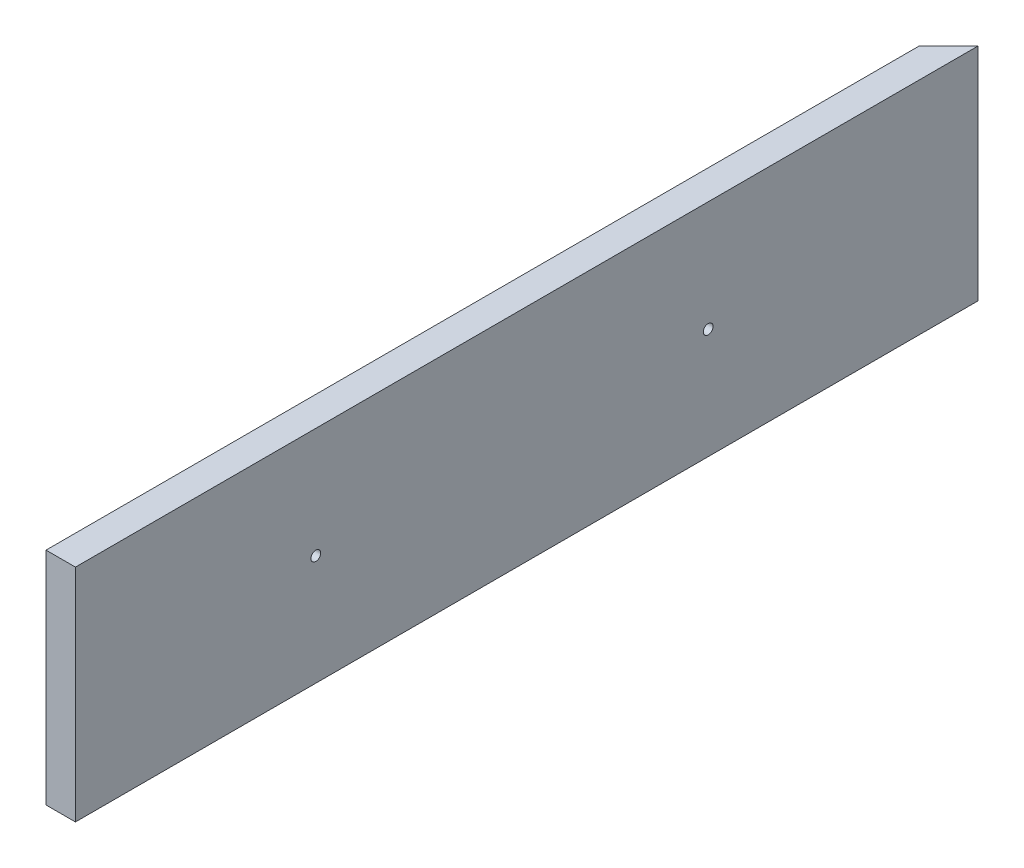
from build123d import *

# Parameters (mm, degrees)
BOSS_EXTRUDE1_DEPTH = 285.75
SKETCH2_R           = 6.35
CUT_EXTRUDE1_DEPTH  = 1204.438088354


with BuildPart() as part:
    # Sketch1 → Boss-Extrude1 (new body)
    with BuildSketch(Plane(origin=(0, 0, 0), x_dir=(1, 0, 0), z_dir=(0, 1, 0))):
        Polygon((0, 1130.3), (38.1, 1168.4), (38.1, 1130.3), (38.1, 0), (0, 0), align=None)
    extrude(amount=BOSS_EXTRUDE1_DEPTH)

    # Sketch2 → Cut-Extrude1 (cut, through all)
    with BuildSketch(Plane.ZY):
        with Locations((-819.15, 142.875)):
            Circle(SKETCH2_R)
        with Locations((-311.15, 142.875)):
            Circle(SKETCH2_R)
    extrude(amount=-CUT_EXTRUDE1_DEPTH, mode=Mode.SUBTRACT)


solid = part.part
